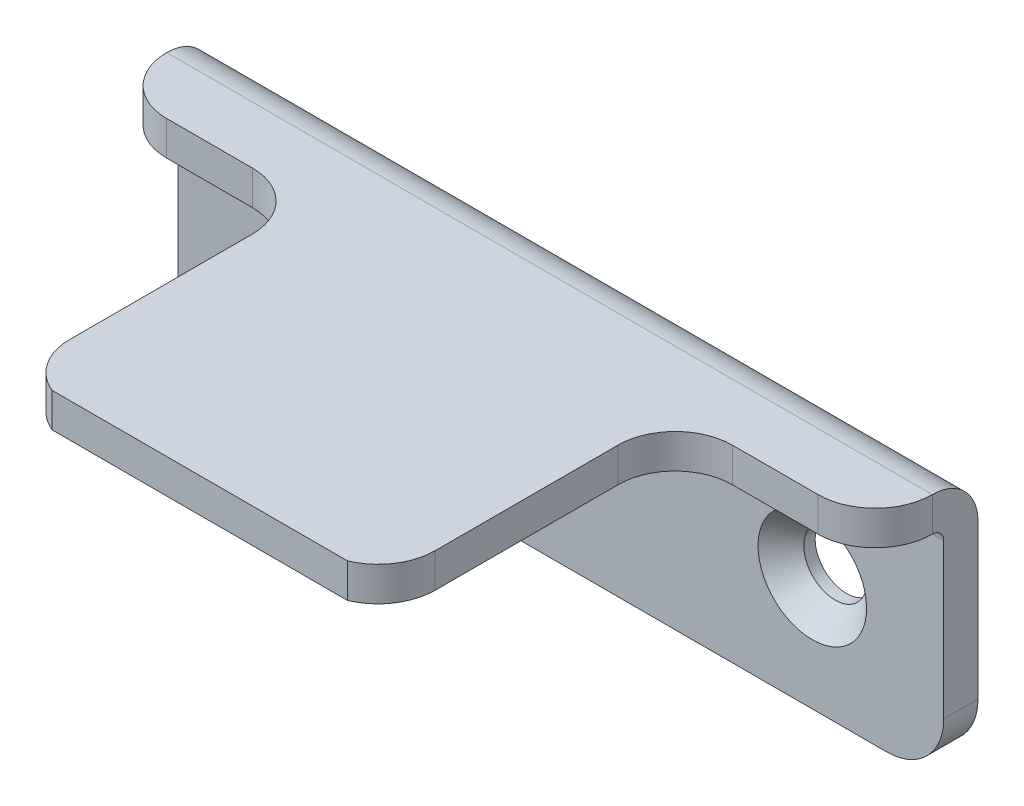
ISO-10303-21;
HEADER;
FILE_DESCRIPTION(('STEP AP214'),'2;1');
FILE_NAME('part.step','',(''),(''),'','','');
FILE_SCHEMA(('AUTOMOTIVE_DESIGN { 1 0 10303 214 1 1 1 1 }'));
ENDSEC;
DATA;
#1=APPLICATION_CONTEXT('core data for automotive mechanical design processes');
#2=APPLICATION_PROTOCOL_DEFINITION('international standard','automotive_design',2000,#1);
#3=PRODUCT_CONTEXT('',#1,'mechanical');
#4=PRODUCT('Part','Part','',(#3));
#5=PRODUCT_RELATED_PRODUCT_CATEGORY('part','',(#4));
#6=PRODUCT_DEFINITION_FORMATION('','',#4);
#7=PRODUCT_DEFINITION_CONTEXT('part definition',#1,'design');
#8=PRODUCT_DEFINITION('design','',#6,#7);
#9=PRODUCT_DEFINITION_SHAPE('','',#8);
#10=(LENGTH_UNIT() NAMED_UNIT(*) SI_UNIT(.MILLI.,.METRE.));
#11=(NAMED_UNIT(*) PLANE_ANGLE_UNIT() SI_UNIT($,.RADIAN.));
#12=(NAMED_UNIT(*) SI_UNIT($,.STERADIAN.) SOLID_ANGLE_UNIT());
#13=UNCERTAINTY_MEASURE_WITH_UNIT(LENGTH_MEASURE(1.E-05),#10,'distance_accuracy_value','');
#14=(GEOMETRIC_REPRESENTATION_CONTEXT(3) GLOBAL_UNCERTAINTY_ASSIGNED_CONTEXT((#13)) GLOBAL_UNIT_ASSIGNED_CONTEXT((#10,
#11,#12)) REPRESENTATION_CONTEXT('',''));
#15=CARTESIAN_POINT('',(0.,0.,0.));
#16=DIRECTION('',(0.,0.,1.));
#17=DIRECTION('',(1.,0.,0.));
#18=AXIS2_PLACEMENT_3D('',#15,#16,#17);
#19=CARTESIAN_POINT('',(-22.,10.5,27.));
#20=DIRECTION('',(0.,1.,0.));
#21=DIRECTION('',(0.,0.,1.));
#22=AXIS2_PLACEMENT_3D('',#19,#20,#21);
#23=PLANE('',#22);
#24=CARTESIAN_POINT('',(-22.,10.5,27.));
#25=DIRECTION('',(0.,1.,0.));
#26=DIRECTION('',(0.,0.,1.));
#27=AXIS2_PLACEMENT_3D('',#24,#25,#26);
#28=CIRCLE('',#27,1.5);
#29=CARTESIAN_POINT('',(-22.,10.5,28.5));
#30=VERTEX_POINT('',#29);
#31=EDGE_CURVE('E18',#30,#30,#28,.F.);
#32=ORIENTED_EDGE('',*,*,#31,.T.);
#33=EDGE_LOOP('',(#32));
#34=FACE_BOUND('',#33,.T.);
#35=ADVANCED_FACE('F15',(#34),#23,.F.);
#36=CARTESIAN_POINT('',(-22.,9.49999999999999,27.));
#37=DIRECTION('',(0.,1.,0.));
#38=DIRECTION('',(0.,0.,1.));
#39=AXIS2_PLACEMENT_3D('',#36,#37,#38);
#40=CYLINDRICAL_SURFACE('',#39,1.5);
#41=CARTESIAN_POINT('',(-22.,9.49999999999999,27.));
#42=DIRECTION('',(0.,1.,0.));
#43=DIRECTION('',(0.,0.,1.));
#44=AXIS2_PLACEMENT_3D('',#41,#42,#43);
#45=CIRCLE('',#44,1.5);
#46=CARTESIAN_POINT('',(-22.,9.49999999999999,28.5));
#47=VERTEX_POINT('',#46);
#48=EDGE_CURVE('E177',#47,#47,#45,.T.);
#49=ORIENTED_EDGE('',*,*,#48,.F.);
#50=EDGE_LOOP('',(#49));
#51=FACE_BOUND('',#50,.T.);
#52=ORIENTED_EDGE('',*,*,#31,.F.);
#53=EDGE_LOOP('',(#52));
#54=FACE_BOUND('',#53,.T.);
#55=ADVANCED_FACE('F422',(#51,#54),#40,.F.);
#56=CARTESIAN_POINT('',(-43.0000000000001,23.5,9.00000000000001));
#57=DIRECTION('',(0.,0.,-1.));
#58=DIRECTION('',(-1.,0.,0.));
#59=AXIS2_PLACEMENT_3D('',#56,#57,#58);
#60=PLANE('',#59);
#61=DIRECTION('',(0.,-1.,0.));
#62=VECTOR('',#61,1.);
#63=CARTESIAN_POINT('',(-50.5000000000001,23.5,9.00000000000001));
#64=LINE('',#63,#62);
#65=CARTESIAN_POINT('',(-50.5000000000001,9.49999999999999,9.00000000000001));
#66=VERTEX_POINT('',#65);
#67=CARTESIAN_POINT('',(-50.5000000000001,12.5,9.00000000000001));
#68=VERTEX_POINT('',#67);
#69=EDGE_CURVE('E188',#66,#68,#64,.F.);
#70=ORIENTED_EDGE('',*,*,#69,.F.);
#71=DIRECTION('',(1.,0.,0.));
#72=VECTOR('',#71,1.);
#73=CARTESIAN_POINT('',(11.5,9.49999999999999,9.00000000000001));
#74=LINE('',#73,#72);
#75=CARTESIAN_POINT('',(-43.0000000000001,9.49999999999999,9.00000000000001));
#76=VERTEX_POINT('',#75);
#77=EDGE_CURVE('E176',#76,#66,#74,.F.);
#78=ORIENTED_EDGE('',*,*,#77,.F.);
#79=DIRECTION('',(0.,-1.,0.));
#80=VECTOR('',#79,1.);
#81=CARTESIAN_POINT('',(-43.0000000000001,23.5,9.00000000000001));
#82=LINE('',#81,#80);
#83=CARTESIAN_POINT('',(-43.0000000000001,12.5,9.00000000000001));
#84=VERTEX_POINT('',#83);
#85=EDGE_CURVE('E251',#76,#84,#82,.F.);
#86=ORIENTED_EDGE('',*,*,#85,.T.);
#87=DIRECTION('',(1.,0.,0.));
#88=VECTOR('',#87,1.);
#89=CARTESIAN_POINT('',(11.5,12.5,9.00000000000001));
#90=LINE('',#89,#88);
#91=EDGE_CURVE('E192',#68,#84,#90,.T.);
#92=ORIENTED_EDGE('',*,*,#91,.F.);
#93=EDGE_LOOP('',(#70,#78,#86,#92));
#94=FACE_BOUND('',#93,.T.);
#95=ADVANCED_FACE('F420',(#94),#60,.F.);
#96=CARTESIAN_POINT('',(-43.0000000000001,23.5,14.));
#97=DIRECTION('',(0.,-1.,0.));
#98=DIRECTION('',(0.,0.,-1.));
#99=AXIS2_PLACEMENT_3D('',#96,#97,#98);
#100=CYLINDRICAL_SURFACE('',#99,5.);
#101=ORIENTED_EDGE('',*,*,#85,.F.);
#102=CARTESIAN_POINT('',(-43.0000000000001,9.49999999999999,14.));
#103=DIRECTION('',(0.,-1.,0.));
#104=DIRECTION('',(0.,0.,-1.));
#105=AXIS2_PLACEMENT_3D('',#102,#103,#104);
#106=CIRCLE('',#105,5.);
#107=CARTESIAN_POINT('',(-38.0000000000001,9.49999999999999,14.));
#108=VERTEX_POINT('',#107);
#109=EDGE_CURVE('E174',#108,#76,#106,.F.);
#110=ORIENTED_EDGE('',*,*,#109,.F.);
#111=DIRECTION('',(0.,1.,0.));
#112=VECTOR('',#111,1.);
#113=CARTESIAN_POINT('',(-38.0000000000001,23.5,14.));
#114=LINE('',#113,#112);
#115=CARTESIAN_POINT('',(-38.0000000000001,12.5,14.));
#116=VERTEX_POINT('',#115);
#117=EDGE_CURVE('E253',#108,#116,#114,.T.);
#118=ORIENTED_EDGE('',*,*,#117,.T.);
#119=CARTESIAN_POINT('',(-43.0000000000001,12.5,14.));
#120=DIRECTION('',(0.,-1.,0.));
#121=DIRECTION('',(0.,0.,-1.));
#122=AXIS2_PLACEMENT_3D('',#119,#120,#121);
#123=CIRCLE('',#122,5.);
#124=EDGE_CURVE('E193',#84,#116,#123,.T.);
#125=ORIENTED_EDGE('',*,*,#124,.F.);
#126=EDGE_LOOP('',(#101,#110,#118,#125));
#127=FACE_BOUND('',#126,.T.);
#128=ADVANCED_FACE('F416',(#127),#100,.F.);
#129=CARTESIAN_POINT('',(-38.0000000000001,23.5,30.));
#130=DIRECTION('',(1.,0.,0.));
#131=DIRECTION('',(0.,0.,-1.));
#132=AXIS2_PLACEMENT_3D('',#129,#130,#131);
#133=PLANE('',#132);
#134=ORIENTED_EDGE('',*,*,#117,.F.);
#135=DIRECTION('',(0.,0.,-1.));
#136=VECTOR('',#135,1.);
#137=CARTESIAN_POINT('',(-38.0000000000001,9.49999999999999,8.99999999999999));
#138=LINE('',#137,#136);
#139=CARTESIAN_POINT('',(-38.0000000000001,9.49999999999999,30.));
#140=VERTEX_POINT('',#139);
#141=EDGE_CURVE('E173',#140,#108,#138,.T.);
#142=ORIENTED_EDGE('',*,*,#141,.F.);
#143=DIRECTION('',(0.,-1.,0.));
#144=VECTOR('',#143,1.);
#145=CARTESIAN_POINT('',(-38.0000000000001,23.5,30.));
#146=LINE('',#145,#144);
#147=CARTESIAN_POINT('',(-38.0000000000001,12.5,30.));
#148=VERTEX_POINT('',#147);
#149=EDGE_CURVE('E255',#148,#140,#146,.T.);
#150=ORIENTED_EDGE('',*,*,#149,.F.);
#151=DIRECTION('',(0.,0.,1.));
#152=VECTOR('',#151,1.);
#153=CARTESIAN_POINT('',(-38.0000000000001,12.5,30.));
#154=LINE('',#153,#152);
#155=EDGE_CURVE('E196',#116,#148,#154,.T.);
#156=ORIENTED_EDGE('',*,*,#155,.F.);
#157=EDGE_LOOP('',(#134,#142,#150,#156));
#158=FACE_BOUND('',#157,.T.);
#159=ADVANCED_FACE('F413',(#158),#133,.F.);
#160=CARTESIAN_POINT('',(-33.0000000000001,23.5,30.));
#161=DIRECTION('',(0.,-1.,0.));
#162=DIRECTION('',(0.,0.,-1.));
#163=AXIS2_PLACEMENT_3D('',#160,#161,#162);
#164=CYLINDRICAL_SURFACE('',#163,5.);
#165=CARTESIAN_POINT('',(-33.0000000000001,9.49999999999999,30.));
#166=DIRECTION('',(0.,-1.,0.));
#167=DIRECTION('',(0.,0.,-1.));
#168=AXIS2_PLACEMENT_3D('',#165,#166,#167);
#169=CIRCLE('',#168,5.);
#170=CARTESIAN_POINT('',(-34.923076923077,9.49999999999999,34.6153846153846));
#171=VERTEX_POINT('',#170);
#172=EDGE_CURVE('E170',#171,#140,#169,.T.);
#173=ORIENTED_EDGE('',*,*,#172,.F.);
#174=DIRECTION('',(0.,1.,0.));
#175=VECTOR('',#174,1.);
#176=CARTESIAN_POINT('',(-34.923076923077,23.5,34.6153846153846));
#177=LINE('',#176,#175);
#178=CARTESIAN_POINT('',(-34.923076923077,12.5,34.6153846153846));
#179=VERTEX_POINT('',#178);
#180=EDGE_CURVE('E257',#171,#179,#177,.T.);
#181=ORIENTED_EDGE('',*,*,#180,.T.);
#182=CARTESIAN_POINT('',(-33.0000000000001,12.5,30.));
#183=DIRECTION('',(0.,-1.,0.));
#184=DIRECTION('',(0.,0.,-1.));
#185=AXIS2_PLACEMENT_3D('',#182,#183,#184);
#186=CIRCLE('',#185,5.);
#187=EDGE_CURVE('E197',#148,#179,#186,.F.);
#188=ORIENTED_EDGE('',*,*,#187,.F.);
#189=ORIENTED_EDGE('',*,*,#149,.T.);
#190=EDGE_LOOP('',(#173,#181,#188,#189));
#191=FACE_BOUND('',#190,.T.);
#192=ADVANCED_FACE('F409',(#191),#164,.T.);
#193=CARTESIAN_POINT('',(-9.07692307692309,23.5,34.6153846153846));
#194=DIRECTION('',(0.,0.,-1.));
#195=DIRECTION('',(-1.,0.,0.));
#196=AXIS2_PLACEMENT_3D('',#193,#194,#195);
#197=PLANE('',#196);
#198=ORIENTED_EDGE('',*,*,#180,.F.);
#199=DIRECTION('',(1.,0.,0.));
#200=VECTOR('',#199,1.);
#201=CARTESIAN_POINT('',(11.5,9.49999999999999,34.6153846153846));
#202=LINE('',#201,#200);
#203=CARTESIAN_POINT('',(-9.07692307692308,9.49999999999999,34.6153846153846));
#204=VERTEX_POINT('',#203);
#205=EDGE_CURVE('E169',#204,#171,#202,.F.);
#206=ORIENTED_EDGE('',*,*,#205,.F.);
#207=DIRECTION('',(0.,-1.,0.));
#208=VECTOR('',#207,1.);
#209=CARTESIAN_POINT('',(-9.07692307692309,23.5,34.6153846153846));
#210=LINE('',#209,#208);
#211=CARTESIAN_POINT('',(-9.07692307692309,12.5,34.6153846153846));
#212=VERTEX_POINT('',#211);
#213=EDGE_CURVE('E259',#212,#204,#210,.T.);
#214=ORIENTED_EDGE('',*,*,#213,.F.);
#215=DIRECTION('',(1.,0.,0.));
#216=VECTOR('',#215,1.);
#217=CARTESIAN_POINT('',(11.5,12.5,34.6153846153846));
#218=LINE('',#217,#216);
#219=EDGE_CURVE('E200',#179,#212,#218,.T.);
#220=ORIENTED_EDGE('',*,*,#219,.F.);
#221=EDGE_LOOP('',(#198,#206,#214,#220));
#222=FACE_BOUND('',#221,.T.);
#223=ADVANCED_FACE('F406',(#222),#197,.F.);
#224=CARTESIAN_POINT('',(-11.,23.5,30.));
#225=DIRECTION('',(0.,-1.,0.));
#226=DIRECTION('',(0.,0.,-1.));
#227=AXIS2_PLACEMENT_3D('',#224,#225,#226);
#228=CYLINDRICAL_SURFACE('',#227,5.);
#229=CARTESIAN_POINT('',(-11.,9.49999999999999,30.));
#230=DIRECTION('',(0.,-1.,0.));
#231=DIRECTION('',(0.,0.,-1.));
#232=AXIS2_PLACEMENT_3D('',#229,#230,#231);
#233=CIRCLE('',#232,5.);
#234=CARTESIAN_POINT('',(-6.00000000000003,9.49999999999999,30.));
#235=VERTEX_POINT('',#234);
#236=EDGE_CURVE('E160',#235,#204,#233,.T.);
#237=ORIENTED_EDGE('',*,*,#236,.F.);
#238=DIRECTION('',(0.,1.,0.));
#239=VECTOR('',#238,1.);
#240=CARTESIAN_POINT('',(-6.00000000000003,23.5,30.));
#241=LINE('',#240,#239);
#242=CARTESIAN_POINT('',(-6.00000000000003,12.5,30.));
#243=VERTEX_POINT('',#242);
#244=EDGE_CURVE('E152',#235,#243,#241,.T.);
#245=ORIENTED_EDGE('',*,*,#244,.T.);
#246=CARTESIAN_POINT('',(-11.,12.5,30.));
#247=DIRECTION('',(0.,-1.,0.));
#248=DIRECTION('',(0.,0.,-1.));
#249=AXIS2_PLACEMENT_3D('',#246,#247,#248);
#250=CIRCLE('',#249,5.);
#251=EDGE_CURVE('E201',#212,#243,#250,.F.);
#252=ORIENTED_EDGE('',*,*,#251,.F.);
#253=ORIENTED_EDGE('',*,*,#213,.T.);
#254=EDGE_LOOP('',(#237,#245,#252,#253));
#255=FACE_BOUND('',#254,.T.);
#256=ADVANCED_FACE('F402',(#255),#228,.T.);
#257=CARTESIAN_POINT('',(-6.00000000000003,23.5,14.));
#258=DIRECTION('',(-1.,0.,0.));
#259=DIRECTION('',(0.,0.,1.));
#260=AXIS2_PLACEMENT_3D('',#257,#258,#259);
#261=PLANE('',#260);
#262=ORIENTED_EDGE('',*,*,#244,.F.);
#263=DIRECTION('',(0.,0.,-1.));
#264=VECTOR('',#263,1.);
#265=CARTESIAN_POINT('',(-6.00000000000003,9.49999999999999,8.99999999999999));
#266=LINE('',#265,#264);
#267=CARTESIAN_POINT('',(-6.00000000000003,9.49999999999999,14.));
#268=VERTEX_POINT('',#267);
#269=EDGE_CURVE('E155',#268,#235,#266,.F.);
#270=ORIENTED_EDGE('',*,*,#269,.F.);
#271=DIRECTION('',(0.,-1.,0.));
#272=VECTOR('',#271,1.);
#273=CARTESIAN_POINT('',(-6.00000000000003,23.5,14.));
#274=LINE('',#273,#272);
#275=CARTESIAN_POINT('',(-6.00000000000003,12.5,14.));
#276=VERTEX_POINT('',#275);
#277=EDGE_CURVE('E141',#268,#276,#274,.F.);
#278=ORIENTED_EDGE('',*,*,#277,.T.);
#279=DIRECTION('',(0.,0.,1.));
#280=VECTOR('',#279,1.);
#281=CARTESIAN_POINT('',(-6.00000000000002,12.5,30.));
#282=LINE('',#281,#280);
#283=EDGE_CURVE('E204',#243,#276,#282,.F.);
#284=ORIENTED_EDGE('',*,*,#283,.F.);
#285=EDGE_LOOP('',(#262,#270,#278,#284));
#286=FACE_BOUND('',#285,.T.);
#287=ADVANCED_FACE('F156',(#286),#261,.F.);
#288=CARTESIAN_POINT('',(-1.00000000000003,23.5,14.));
#289=DIRECTION('',(0.,-1.,0.));
#290=DIRECTION('',(0.,0.,-1.));
#291=AXIS2_PLACEMENT_3D('',#288,#289,#290);
#292=CYLINDRICAL_SURFACE('',#291,5.);
#293=ORIENTED_EDGE('',*,*,#277,.F.);
#294=CARTESIAN_POINT('',(-1.00000000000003,9.49999999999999,14.));
#295=DIRECTION('',(0.,-1.,0.));
#296=DIRECTION('',(0.,0.,-1.));
#297=AXIS2_PLACEMENT_3D('',#294,#295,#296);
#298=CIRCLE('',#297,5.);
#299=CARTESIAN_POINT('',(-1.00000000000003,9.49999999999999,8.99999999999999));
#300=VERTEX_POINT('',#299);
#301=EDGE_CURVE('E145',#300,#268,#298,.F.);
#302=ORIENTED_EDGE('',*,*,#301,.F.);
#303=DIRECTION('',(0.,1.,0.));
#304=VECTOR('',#303,1.);
#305=CARTESIAN_POINT('',(-1.00000000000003,23.5,8.99999999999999));
#306=LINE('',#305,#304);
#307=CARTESIAN_POINT('',(-1.00000000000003,12.5,8.99999999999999));
#308=VERTEX_POINT('',#307);
#309=EDGE_CURVE('E136',#300,#308,#306,.T.);
#310=ORIENTED_EDGE('',*,*,#309,.T.);
#311=CARTESIAN_POINT('',(-1.00000000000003,12.5,14.));
#312=DIRECTION('',(0.,-1.,0.));
#313=DIRECTION('',(0.,0.,-1.));
#314=AXIS2_PLACEMENT_3D('',#311,#312,#313);
#315=CIRCLE('',#314,5.);
#316=EDGE_CURVE('E148',#276,#308,#315,.T.);
#317=ORIENTED_EDGE('',*,*,#316,.F.);
#318=EDGE_LOOP('',(#293,#302,#310,#317));
#319=FACE_BOUND('',#318,.T.);
#320=ADVANCED_FACE('F143',(#319),#292,.F.);
#321=CARTESIAN_POINT('',(6.5,23.5,8.99999999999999));
#322=DIRECTION('',(0.,0.,-1.));
#323=DIRECTION('',(-1.,0.,0.));
#324=AXIS2_PLACEMENT_3D('',#321,#322,#323);
#325=PLANE('',#324);
#326=ORIENTED_EDGE('',*,*,#309,.F.);
#327=DIRECTION('',(1.,0.,0.));
#328=VECTOR('',#327,1.);
#329=CARTESIAN_POINT('',(11.5,9.49999999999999,8.99999999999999));
#330=LINE('',#329,#328);
#331=CARTESIAN_POINT('',(6.5,9.49999999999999,8.99999999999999));
#332=VERTEX_POINT('',#331);
#333=EDGE_CURVE('E165',#332,#300,#330,.F.);
#334=ORIENTED_EDGE('',*,*,#333,.F.);
#335=DIRECTION('',(0.,-1.,0.));
#336=VECTOR('',#335,1.);
#337=CARTESIAN_POINT('',(6.5,23.5,8.99999999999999));
#338=LINE('',#337,#336);
#339=CARTESIAN_POINT('',(6.5,12.5,8.99999999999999));
#340=VERTEX_POINT('',#339);
#341=EDGE_CURVE('E210',#340,#332,#338,.T.);
#342=ORIENTED_EDGE('',*,*,#341,.F.);
#343=DIRECTION('',(1.,0.,0.));
#344=VECTOR('',#343,1.);
#345=CARTESIAN_POINT('',(11.5,12.5,8.99999999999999));
#346=LINE('',#345,#344);
#347=EDGE_CURVE('E206',#308,#340,#346,.T.);
#348=ORIENTED_EDGE('',*,*,#347,.F.);
#349=EDGE_LOOP('',(#326,#334,#342,#348));
#350=FACE_BOUND('',#349,.T.);
#351=ADVANCED_FACE('F396',(#350),#325,.F.);
#352=CARTESIAN_POINT('',(11.5,9.49999999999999,8.99999999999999));
#353=DIRECTION('',(0.,-1.,0.));
#354=DIRECTION('',(0.,0.,-1.));
#355=AXIS2_PLACEMENT_3D('',#352,#353,#354);
#356=PLANE('',#355);
#357=ORIENTED_EDGE('',*,*,#48,.T.);
#358=EDGE_LOOP('',(#357));
#359=FACE_BOUND('',#358,.T.);
#360=ORIENTED_EDGE('',*,*,#109,.T.);
#361=ORIENTED_EDGE('',*,*,#77,.T.);
#362=CARTESIAN_POINT('',(-50.5000000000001,9.49999999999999,4.00000000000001));
#363=DIRECTION('',(0.,-1.,0.));
#364=DIRECTION('',(0.,0.,-1.));
#365=AXIS2_PLACEMENT_3D('',#362,#363,#364);
#366=CIRCLE('',#365,5.);
#367=CARTESIAN_POINT('',(-55.5,9.49999999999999,4.));
#368=VERTEX_POINT('',#367);
#369=EDGE_CURVE('E185',#368,#66,#366,.F.);
#370=ORIENTED_EDGE('',*,*,#369,.F.);
#371=DIRECTION('',(-1.,0.,0.));
#372=VECTOR('',#371,1.);
#373=CARTESIAN_POINT('',(11.5,9.49999999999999,3.99999999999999));
#374=LINE('',#373,#372);
#375=CARTESIAN_POINT('',(11.5,9.49999999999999,4.));
#376=VERTEX_POINT('',#375);
#377=EDGE_CURVE('E180',#368,#376,#374,.F.);
#378=ORIENTED_EDGE('',*,*,#377,.T.);
#379=CARTESIAN_POINT('',(6.50000000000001,9.49999999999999,3.99999999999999));
#380=DIRECTION('',(0.,-1.,0.));
#381=DIRECTION('',(0.,0.,-1.));
#382=AXIS2_PLACEMENT_3D('',#379,#380,#381);
#383=CIRCLE('',#382,5.);
#384=EDGE_CURVE('E211',#332,#376,#383,.F.);
#385=ORIENTED_EDGE('',*,*,#384,.F.);
#386=ORIENTED_EDGE('',*,*,#333,.T.);
#387=ORIENTED_EDGE('',*,*,#301,.T.);
#388=ORIENTED_EDGE('',*,*,#269,.T.);
#389=ORIENTED_EDGE('',*,*,#236,.T.);
#390=ORIENTED_EDGE('',*,*,#205,.T.);
#391=ORIENTED_EDGE('',*,*,#172,.T.);
#392=ORIENTED_EDGE('',*,*,#141,.T.);
#393=EDGE_LOOP('',(#360,#361,#370,#378,#385,#386,#387,#388,#389,#390,#391,#392));
#394=FACE_BOUND('',#393,.T.);
#395=ADVANCED_FACE('F163',(#359,#394),#356,.T.);
#396=CARTESIAN_POINT('',(11.5,8.49999999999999,3.99999999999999));
#397=DIRECTION('',(-1.,0.,0.));
#398=DIRECTION('',(0.,0.,1.));
#399=AXIS2_PLACEMENT_3D('',#396,#397,#398);
#400=CYLINDRICAL_SURFACE('',#399,1.);
#401=DIRECTION('',(1.,0.,0.));
#402=VECTOR('',#401,1.);
#403=CARTESIAN_POINT('',(11.5,8.49999999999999,2.99999999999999));
#404=LINE('',#403,#402);
#405=CARTESIAN_POINT('',(11.5,8.49999999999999,2.99999999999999));
#406=VERTEX_POINT('',#405);
#407=CARTESIAN_POINT('',(-55.5,8.49999999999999,2.99999999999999));
#408=VERTEX_POINT('',#407);
#409=EDGE_CURVE('E214',#406,#408,#404,.F.);
#410=ORIENTED_EDGE('',*,*,#409,.F.);
#411=CARTESIAN_POINT('',(11.5,8.49999999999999,3.99999999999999));
#412=DIRECTION('',(-1.,0.,0.));
#413=DIRECTION('',(0.,0.,1.));
#414=AXIS2_PLACEMENT_3D('',#411,#412,#413);
#415=CIRCLE('',#414,1.);
#416=EDGE_CURVE('E181',#376,#406,#415,.T.);
#417=ORIENTED_EDGE('',*,*,#416,.F.);
#418=ORIENTED_EDGE('',*,*,#377,.F.);
#419=CARTESIAN_POINT('',(-55.5,8.49999999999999,3.99999999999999));
#420=DIRECTION('',(-1.,0.,0.));
#421=DIRECTION('',(0.,0.,1.));
#422=AXIS2_PLACEMENT_3D('',#419,#420,#421);
#423=CIRCLE('',#422,1.);
#424=EDGE_CURVE('E183',#408,#368,#423,.F.);
#425=ORIENTED_EDGE('',*,*,#424,.F.);
#426=EDGE_LOOP('',(#410,#417,#418,#425));
#427=FACE_BOUND('',#426,.T.);
#428=ADVANCED_FACE('F393',(#427),#400,.F.);
#429=CARTESIAN_POINT('',(-50.5000000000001,23.5,4.00000000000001));
#430=DIRECTION('',(0.,-1.,0.));
#431=DIRECTION('',(0.,0.,-1.));
#432=AXIS2_PLACEMENT_3D('',#429,#430,#431);
#433=CYLINDRICAL_SURFACE('',#432,5.);
#434=ORIENTED_EDGE('',*,*,#369,.T.);
#435=ORIENTED_EDGE('',*,*,#69,.T.);
#436=CARTESIAN_POINT('',(-50.5000000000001,12.5,4.00000000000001));
#437=DIRECTION('',(0.,-1.,0.));
#438=DIRECTION('',(0.,0.,-1.));
#439=AXIS2_PLACEMENT_3D('',#436,#437,#438);
#440=CIRCLE('',#439,5.);
#441=CARTESIAN_POINT('',(-55.5,12.5,4.));
#442=VERTEX_POINT('',#441);
#443=EDGE_CURVE('E189',#442,#68,#440,.F.);
#444=ORIENTED_EDGE('',*,*,#443,.F.);
#445=DIRECTION('',(0.,1.,0.));
#446=VECTOR('',#445,1.);
#447=CARTESIAN_POINT('',(-55.5,6.56286455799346,4.));
#448=LINE('',#447,#446);
#449=EDGE_CURVE('E287',#442,#368,#448,.F.);
#450=ORIENTED_EDGE('',*,*,#449,.T.);
#451=EDGE_LOOP('',(#434,#435,#444,#450));
#452=FACE_BOUND('',#451,.T.);
#453=ADVANCED_FACE('F390',(#452),#433,.T.);
#454=CARTESIAN_POINT('',(11.5,12.5,30.));
#455=DIRECTION('',(0.,1.,0.));
#456=DIRECTION('',(0.,0.,1.));
#457=AXIS2_PLACEMENT_3D('',#454,#455,#456);
#458=PLANE('',#457);
#459=CARTESIAN_POINT('',(6.50000000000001,12.5,3.99999999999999));
#460=DIRECTION('',(0.,-1.,0.));
#461=DIRECTION('',(0.,0.,-1.));
#462=AXIS2_PLACEMENT_3D('',#459,#460,#461);
#463=CIRCLE('',#462,5.);
#464=CARTESIAN_POINT('',(11.5,12.5,4.));
#465=VERTEX_POINT('',#464);
#466=EDGE_CURVE('E207',#465,#340,#463,.T.);
#467=ORIENTED_EDGE('',*,*,#466,.F.);
#468=DIRECTION('',(-1.,0.,0.));
#469=VECTOR('',#468,1.);
#470=CARTESIAN_POINT('',(11.5,12.5,4.));
#471=LINE('',#470,#469);
#472=EDGE_CURVE('E227',#442,#465,#471,.F.);
#473=ORIENTED_EDGE('',*,*,#472,.F.);
#474=ORIENTED_EDGE('',*,*,#443,.T.);
#475=ORIENTED_EDGE('',*,*,#91,.T.);
#476=ORIENTED_EDGE('',*,*,#124,.T.);
#477=ORIENTED_EDGE('',*,*,#155,.T.);
#478=ORIENTED_EDGE('',*,*,#187,.T.);
#479=ORIENTED_EDGE('',*,*,#219,.T.);
#480=ORIENTED_EDGE('',*,*,#251,.T.);
#481=ORIENTED_EDGE('',*,*,#283,.T.);
#482=ORIENTED_EDGE('',*,*,#316,.T.);
#483=ORIENTED_EDGE('',*,*,#347,.T.);
#484=EDGE_LOOP('',(#467,#473,#474,#475,#476,#477,#478,#479,#480,#481,#482,#483));
#485=FACE_BOUND('',#484,.T.);
#486=ADVANCED_FACE('F398',(#485),#458,.T.);
#487=CARTESIAN_POINT('',(6.50000000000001,23.5,3.99999999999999));
#488=DIRECTION('',(0.,-1.,0.));
#489=DIRECTION('',(0.,0.,-1.));
#490=AXIS2_PLACEMENT_3D('',#487,#488,#489);
#491=CYLINDRICAL_SURFACE('',#490,5.);
#492=ORIENTED_EDGE('',*,*,#384,.T.);
#493=DIRECTION('',(0.,1.,0.));
#494=VECTOR('',#493,1.);
#495=CARTESIAN_POINT('',(11.5,6.56286455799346,4.));
#496=LINE('',#495,#494);
#497=EDGE_CURVE('E232',#465,#376,#496,.F.);
#498=ORIENTED_EDGE('',*,*,#497,.F.);
#499=ORIENTED_EDGE('',*,*,#466,.T.);
#500=ORIENTED_EDGE('',*,*,#341,.T.);
#501=EDGE_LOOP('',(#492,#498,#499,#500));
#502=FACE_BOUND('',#501,.T.);
#503=ADVANCED_FACE('F381',(#502),#491,.T.);
#504=CARTESIAN_POINT('',(11.5,-5.00000000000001,2.99999999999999));
#505=DIRECTION('',(0.,0.,1.));
#506=DIRECTION('',(1.,0.,0.));
#507=AXIS2_PLACEMENT_3D('',#504,#505,#506);
#508=PLANE('',#507);
#509=CARTESIAN_POINT('',(-44.,0.,3.00000000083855));
#510=DIRECTION('',(0.,0.,1.));
#511=DIRECTION('',(1.,0.,0.));
#512=AXIS2_PLACEMENT_3D('',#509,#510,#511);
#513=CIRCLE('',#512,4.7499999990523);
#514=CARTESIAN_POINT('',(-39.2500000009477,0.,3.00000000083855));
#515=VERTEX_POINT('',#514);
#516=EDGE_CURVE('E218',#515,#515,#513,.F.);
#517=ORIENTED_EDGE('',*,*,#516,.T.);
#518=EDGE_LOOP('',(#517));
#519=FACE_BOUND('',#518,.T.);
#520=CARTESIAN_POINT('',(0.,0.,3.0000000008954));
#521=DIRECTION('',(0.,0.,1.));
#522=DIRECTION('',(0.,-1.,0.));
#523=AXIS2_PLACEMENT_3D('',#520,#521,#522);
#524=CIRCLE('',#523,4.74999999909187);
#525=CARTESIAN_POINT('',(0.,-4.74999999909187,3.0000000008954));
#526=VERTEX_POINT('',#525);
#527=EDGE_CURVE('E215',#526,#526,#524,.F.);
#528=ORIENTED_EDGE('',*,*,#527,.T.);
#529=EDGE_LOOP('',(#528));
#530=FACE_BOUND('',#529,.T.);
#531=ORIENTED_EDGE('',*,*,#409,.T.);
#532=DIRECTION('',(0.,1.,0.));
#533=VECTOR('',#532,1.);
#534=CARTESIAN_POINT('',(-55.5,6.56286455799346,2.99999999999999));
#535=LINE('',#534,#533);
#536=CARTESIAN_POINT('',(-55.5,-5.,2.99999999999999));
#537=VERTEX_POINT('',#536);
#538=EDGE_CURVE('E228',#408,#537,#535,.F.);
#539=ORIENTED_EDGE('',*,*,#538,.T.);
#540=CARTESIAN_POINT('',(-50.5,-5.,2.99999999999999));
#541=DIRECTION('',(0.,0.,-1.));
#542=DIRECTION('',(-1.,0.,0.));
#543=AXIS2_PLACEMENT_3D('',#540,#541,#542);
#544=CIRCLE('',#543,5.);
#545=CARTESIAN_POINT('',(-50.5,-10.,2.99999999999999));
#546=VERTEX_POINT('',#545);
#547=EDGE_CURVE('E221',#546,#537,#544,.T.);
#548=ORIENTED_EDGE('',*,*,#547,.F.);
#549=DIRECTION('',(1.,0.,0.));
#550=VECTOR('',#549,1.);
#551=CARTESIAN_POINT('',(11.5,-10.,2.99999999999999));
#552=LINE('',#551,#550);
#553=CARTESIAN_POINT('',(6.49999999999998,-10.,2.99999999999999));
#554=VERTEX_POINT('',#553);
#555=EDGE_CURVE('E282',#554,#546,#552,.F.);
#556=ORIENTED_EDGE('',*,*,#555,.F.);
#557=CARTESIAN_POINT('',(6.49999999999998,-5.,2.99999999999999));
#558=DIRECTION('',(0.,0.,-1.));
#559=DIRECTION('',(-1.,0.,0.));
#560=AXIS2_PLACEMENT_3D('',#557,#558,#559);
#561=CIRCLE('',#560,5.);
#562=CARTESIAN_POINT('',(11.5,-5.,2.99999999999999));
#563=VERTEX_POINT('',#562);
#564=EDGE_CURVE('E233',#563,#554,#561,.T.);
#565=ORIENTED_EDGE('',*,*,#564,.F.);
#566=DIRECTION('',(0.,1.,0.));
#567=VECTOR('',#566,1.);
#568=CARTESIAN_POINT('',(11.5,6.56286455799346,2.99999999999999));
#569=LINE('',#568,#567);
#570=EDGE_CURVE('E297',#406,#563,#569,.F.);
#571=ORIENTED_EDGE('',*,*,#570,.F.);
#572=EDGE_LOOP('',(#531,#539,#548,#556,#565,#571));
#573=FACE_BOUND('',#572,.T.);
#574=ADVANCED_FACE('F375',(#519,#530,#573),#508,.T.);
#575=CARTESIAN_POINT('',(0.,0.,3.0000000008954));
#576=DIRECTION('',(0.,0.,1.));
#577=DIRECTION('',(0.,-1.,0.));
#578=AXIS2_PLACEMENT_3D('',#575,#576,#577);
#579=CONICAL_SURFACE('',#578,4.74999999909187,0.785398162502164);
#580=CARTESIAN_POINT('',(0.,0.,0.999999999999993));
#581=DIRECTION('',(0.,0.,1.));
#582=DIRECTION('',(1.,0.,0.));
#583=AXIS2_PLACEMENT_3D('',#580,#581,#582);
#584=CIRCLE('',#583,2.75);
#585=CARTESIAN_POINT('',(2.75,0.,0.999999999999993));
#586=VERTEX_POINT('',#585);
#587=EDGE_CURVE('E285',#586,#586,#584,.F.);
#588=ORIENTED_EDGE('',*,*,#587,.T.);
#589=EDGE_LOOP('',(#588));
#590=FACE_BOUND('',#589,.T.);
#591=ORIENTED_EDGE('',*,*,#527,.F.);
#592=EDGE_LOOP('',(#591));
#593=FACE_BOUND('',#592,.T.);
#594=ADVANCED_FACE('F371',(#590,#593),#579,.F.);
#595=CARTESIAN_POINT('',(-44.,0.,3.00000000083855));
#596=DIRECTION('',(0.,0.,1.));
#597=DIRECTION('',(1.,0.,0.));
#598=AXIS2_PLACEMENT_3D('',#595,#596,#597);
#599=CONICAL_SURFACE('',#598,4.7499999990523,0.785398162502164);
#600=CARTESIAN_POINT('',(-44.,0.,0.999999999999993));
#601=DIRECTION('',(0.,0.,1.));
#602=DIRECTION('',(1.,0.,0.));
#603=AXIS2_PLACEMENT_3D('',#600,#601,#602);
#604=CIRCLE('',#603,2.75);
#605=CARTESIAN_POINT('',(-41.25,0.,0.999999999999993));
#606=VERTEX_POINT('',#605);
#607=EDGE_CURVE('E241',#606,#606,#604,.F.);
#608=ORIENTED_EDGE('',*,*,#607,.T.);
#609=EDGE_LOOP('',(#608));
#610=FACE_BOUND('',#609,.T.);
#611=ORIENTED_EDGE('',*,*,#516,.F.);
#612=EDGE_LOOP('',(#611));
#613=FACE_BOUND('',#612,.T.);
#614=ADVANCED_FACE('F374',(#610,#613),#599,.F.);
#615=CARTESIAN_POINT('',(-50.5,-5.,11.));
#616=DIRECTION('',(0.,0.,-1.));
#617=DIRECTION('',(-1.,0.,0.));
#618=AXIS2_PLACEMENT_3D('',#615,#616,#617);
#619=CYLINDRICAL_SURFACE('',#618,5.);
#620=ORIENTED_EDGE('',*,*,#547,.T.);
#621=DIRECTION('',(0.,0.,-1.));
#622=VECTOR('',#621,1.);
#623=CARTESIAN_POINT('',(-55.5,-5.,12.3059847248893));
#624=LINE('',#623,#622);
#625=CARTESIAN_POINT('',(-55.5,-5.,0.));
#626=VERTEX_POINT('',#625);
#627=EDGE_CURVE('E223',#537,#626,#624,.T.);
#628=ORIENTED_EDGE('',*,*,#627,.T.);
#629=CARTESIAN_POINT('',(-50.5,-5.,0.));
#630=DIRECTION('',(0.,0.,-1.));
#631=DIRECTION('',(-1.,0.,0.));
#632=AXIS2_PLACEMENT_3D('',#629,#630,#631);
#633=CIRCLE('',#632,5.);
#634=CARTESIAN_POINT('',(-50.5,-10.,0.));
#635=VERTEX_POINT('',#634);
#636=EDGE_CURVE('E237',#635,#626,#633,.T.);
#637=ORIENTED_EDGE('',*,*,#636,.F.);
#638=DIRECTION('',(0.,0.,-1.));
#639=VECTOR('',#638,1.);
#640=CARTESIAN_POINT('',(-50.5,-10.,2.99999999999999));
#641=LINE('',#640,#639);
#642=EDGE_CURVE('E235',#546,#635,#641,.T.);
#643=ORIENTED_EDGE('',*,*,#642,.F.);
#644=EDGE_LOOP('',(#620,#628,#637,#643));
#645=FACE_BOUND('',#644,.T.);
#646=ADVANCED_FACE('F324',(#645),#619,.T.);
#647=CARTESIAN_POINT('',(-55.5,6.56286455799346,12.3059847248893));
#648=DIRECTION('',(1.,0.,0.));
#649=DIRECTION('',(0.,0.,-1.));
#650=AXIS2_PLACEMENT_3D('',#647,#648,#649);
#651=PLANE('',#650);
#652=ORIENTED_EDGE('',*,*,#424,.T.);
#653=ORIENTED_EDGE('',*,*,#449,.F.);
#654=CARTESIAN_POINT('',(-55.5,8.49999999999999,4.));
#655=DIRECTION('',(-1.,0.,0.));
#656=DIRECTION('',(0.,0.,1.));
#657=AXIS2_PLACEMENT_3D('',#654,#655,#656);
#658=CIRCLE('',#657,4.);
#659=CARTESIAN_POINT('',(-55.5,8.49999999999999,0.));
#660=VERTEX_POINT('',#659);
#661=EDGE_CURVE('E224',#660,#442,#658,.F.);
#662=ORIENTED_EDGE('',*,*,#661,.F.);
#663=DIRECTION('',(0.,1.,0.));
#664=VECTOR('',#663,1.);
#665=CARTESIAN_POINT('',(-55.5,-10.,0.));
#666=LINE('',#665,#664);
#667=EDGE_CURVE('E240',#626,#660,#666,.T.);
#668=ORIENTED_EDGE('',*,*,#667,.F.);
#669=ORIENTED_EDGE('',*,*,#627,.F.);
#670=ORIENTED_EDGE('',*,*,#538,.F.);
#671=EDGE_LOOP('',(#652,#653,#662,#668,#669,#670));
#672=FACE_BOUND('',#671,.T.);
#673=ADVANCED_FACE('F329',(#672),#651,.F.);
#674=CARTESIAN_POINT('',(11.5,8.49999999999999,4.));
#675=DIRECTION('',(-1.,0.,0.));
#676=DIRECTION('',(0.,0.,1.));
#677=AXIS2_PLACEMENT_3D('',#674,#675,#676);
#678=CYLINDRICAL_SURFACE('',#677,4.);
#679=CARTESIAN_POINT('',(11.5,8.49999999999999,4.));
#680=DIRECTION('',(-1.,0.,0.));
#681=DIRECTION('',(0.,0.,1.));
#682=AXIS2_PLACEMENT_3D('',#679,#680,#681);
#683=CIRCLE('',#682,4.);
#684=CARTESIAN_POINT('',(11.5,8.49999999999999,0.));
#685=VERTEX_POINT('',#684);
#686=EDGE_CURVE('E229',#685,#465,#683,.F.);
#687=ORIENTED_EDGE('',*,*,#686,.F.);
#688=DIRECTION('',(-1.,0.,0.));
#689=VECTOR('',#688,1.);
#690=CARTESIAN_POINT('',(11.5,8.49999999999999,0.));
#691=LINE('',#690,#689);
#692=EDGE_CURVE('E292',#660,#685,#691,.F.);
#693=ORIENTED_EDGE('',*,*,#692,.F.);
#694=ORIENTED_EDGE('',*,*,#661,.T.);
#695=ORIENTED_EDGE('',*,*,#472,.T.);
#696=EDGE_LOOP('',(#687,#693,#694,#695));
#697=FACE_BOUND('',#696,.T.);
#698=ADVANCED_FACE('F334',(#697),#678,.T.);
#699=CARTESIAN_POINT('',(11.5,6.56286455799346,12.3059847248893));
#700=DIRECTION('',(1.,0.,0.));
#701=DIRECTION('',(0.,0.,-1.));
#702=AXIS2_PLACEMENT_3D('',#699,#700,#701);
#703=PLANE('',#702);
#704=ORIENTED_EDGE('',*,*,#416,.T.);
#705=ORIENTED_EDGE('',*,*,#570,.T.);
#706=DIRECTION('',(0.,0.,-1.));
#707=VECTOR('',#706,1.);
#708=CARTESIAN_POINT('',(11.5,-5.,11.));
#709=LINE('',#708,#707);
#710=CARTESIAN_POINT('',(11.5,-5.,0.));
#711=VERTEX_POINT('',#710);
#712=EDGE_CURVE('E236',#711,#563,#709,.F.);
#713=ORIENTED_EDGE('',*,*,#712,.F.);
#714=DIRECTION('',(0.,1.,0.));
#715=VECTOR('',#714,1.);
#716=CARTESIAN_POINT('',(11.5,-10.,0.));
#717=LINE('',#716,#715);
#718=EDGE_CURVE('E246',#685,#711,#717,.F.);
#719=ORIENTED_EDGE('',*,*,#718,.F.);
#720=ORIENTED_EDGE('',*,*,#686,.T.);
#721=ORIENTED_EDGE('',*,*,#497,.T.);
#722=EDGE_LOOP('',(#704,#705,#713,#719,#720,#721));
#723=FACE_BOUND('',#722,.T.);
#724=ADVANCED_FACE('F338',(#723),#703,.T.);
#725=CARTESIAN_POINT('',(6.49999999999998,-5.,11.));
#726=DIRECTION('',(0.,0.,-1.));
#727=DIRECTION('',(-1.,0.,0.));
#728=AXIS2_PLACEMENT_3D('',#725,#726,#727);
#729=CYLINDRICAL_SURFACE('',#728,5.);
#730=ORIENTED_EDGE('',*,*,#564,.T.);
#731=DIRECTION('',(0.,0.,-1.));
#732=VECTOR('',#731,1.);
#733=CARTESIAN_POINT('',(6.49999999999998,-10.,2.99999999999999));
#734=LINE('',#733,#732);
#735=CARTESIAN_POINT('',(6.49999999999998,-10.,0.));
#736=VERTEX_POINT('',#735);
#737=EDGE_CURVE('E33',#736,#554,#734,.F.);
#738=ORIENTED_EDGE('',*,*,#737,.F.);
#739=CARTESIAN_POINT('',(6.49999999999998,-5.,0.));
#740=DIRECTION('',(0.,0.,-1.));
#741=DIRECTION('',(-1.,0.,0.));
#742=AXIS2_PLACEMENT_3D('',#739,#740,#741);
#743=CIRCLE('',#742,5.);
#744=EDGE_CURVE('E242',#711,#736,#743,.T.);
#745=ORIENTED_EDGE('',*,*,#744,.F.);
#746=ORIENTED_EDGE('',*,*,#712,.T.);
#747=EDGE_LOOP('',(#730,#738,#745,#746));
#748=FACE_BOUND('',#747,.T.);
#749=ADVANCED_FACE('F341',(#748),#729,.T.);
#750=CARTESIAN_POINT('',(11.5,-10.,2.99999999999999));
#751=DIRECTION('',(0.,-1.,0.));
#752=DIRECTION('',(0.,0.,-1.));
#753=AXIS2_PLACEMENT_3D('',#750,#751,#752);
#754=PLANE('',#753);
#755=ORIENTED_EDGE('',*,*,#737,.T.);
#756=ORIENTED_EDGE('',*,*,#555,.T.);
#757=ORIENTED_EDGE('',*,*,#642,.T.);
#758=DIRECTION('',(-1.,0.,0.));
#759=VECTOR('',#758,1.);
#760=CARTESIAN_POINT('',(11.5,-10.,0.));
#761=LINE('',#760,#759);
#762=EDGE_CURVE('E245',#736,#635,#761,.T.);
#763=ORIENTED_EDGE('',*,*,#762,.F.);
#764=EDGE_LOOP('',(#755,#756,#757,#763));
#765=FACE_BOUND('',#764,.T.);
#766=ADVANCED_FACE('F320',(#765),#754,.T.);
#767=CARTESIAN_POINT('',(0.,0.,0.499999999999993));
#768=DIRECTION('',(0.,0.,1.));
#769=DIRECTION('',(1.,0.,0.));
#770=AXIS2_PLACEMENT_3D('',#767,#768,#769);
#771=CYLINDRICAL_SURFACE('',#770,2.75);
#772=CARTESIAN_POINT('',(0.,0.,0.));
#773=DIRECTION('',(0.,0.,1.));
#774=DIRECTION('',(1.,0.,0.));
#775=AXIS2_PLACEMENT_3D('',#772,#773,#774);
#776=CIRCLE('',#775,2.75);
#777=CARTESIAN_POINT('',(2.75,0.,0.));
#778=VERTEX_POINT('',#777);
#779=EDGE_CURVE('E24',#778,#778,#776,.T.);
#780=ORIENTED_EDGE('',*,*,#779,.F.);
#781=EDGE_LOOP('',(#780));
#782=FACE_BOUND('',#781,.T.);
#783=ORIENTED_EDGE('',*,*,#587,.F.);
#784=EDGE_LOOP('',(#783));
#785=FACE_BOUND('',#784,.T.);
#786=ADVANCED_FACE('F349',(#782,#785),#771,.F.);
#787=CARTESIAN_POINT('',(-44.,0.,0.499999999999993));
#788=DIRECTION('',(0.,0.,1.));
#789=DIRECTION('',(1.,0.,0.));
#790=AXIS2_PLACEMENT_3D('',#787,#788,#789);
#791=CYLINDRICAL_SURFACE('',#790,2.75);
#792=CARTESIAN_POINT('',(-44.,0.,0.));
#793=DIRECTION('',(0.,0.,1.));
#794=DIRECTION('',(1.,0.,0.));
#795=AXIS2_PLACEMENT_3D('',#792,#793,#794);
#796=CIRCLE('',#795,2.75);
#797=CARTESIAN_POINT('',(-41.25,0.,0.));
#798=VERTEX_POINT('',#797);
#799=EDGE_CURVE('E10',#798,#798,#796,.T.);
#800=ORIENTED_EDGE('',*,*,#799,.F.);
#801=EDGE_LOOP('',(#800));
#802=FACE_BOUND('',#801,.T.);
#803=ORIENTED_EDGE('',*,*,#607,.F.);
#804=EDGE_LOOP('',(#803));
#805=FACE_BOUND('',#804,.T.);
#806=ADVANCED_FACE('F353',(#802,#805),#791,.F.);
#807=CARTESIAN_POINT('',(11.5,-10.,0.));
#808=DIRECTION('',(0.,0.,-1.));
#809=DIRECTION('',(-1.,0.,0.));
#810=AXIS2_PLACEMENT_3D('',#807,#808,#809);
#811=PLANE('',#810);
#812=ORIENTED_EDGE('',*,*,#799,.T.);
#813=EDGE_LOOP('',(#812));
#814=FACE_BOUND('',#813,.T.);
#815=ORIENTED_EDGE('',*,*,#779,.T.);
#816=EDGE_LOOP('',(#815));
#817=FACE_BOUND('',#816,.T.);
#818=ORIENTED_EDGE('',*,*,#744,.T.);
#819=ORIENTED_EDGE('',*,*,#762,.T.);
#820=ORIENTED_EDGE('',*,*,#636,.T.);
#821=ORIENTED_EDGE('',*,*,#667,.T.);
#822=ORIENTED_EDGE('',*,*,#692,.T.);
#823=ORIENTED_EDGE('',*,*,#718,.T.);
#824=EDGE_LOOP('',(#818,#819,#820,#821,#822,#823));
#825=FACE_BOUND('',#824,.T.);
#826=ADVANCED_FACE('F318',(#814,#817,#825),#811,.T.);
#827=CLOSED_SHELL('',(#35,#55,#95,#128,#159,#192,#223,#256,#287,#320,#351,#395,#428,#453,#486,
#503,#574,#594,#614,#646,#673,#698,#724,#749,#766,#786,#806,#826));
#828=MANIFOLD_SOLID_BREP('B1',#827);
#829=ADVANCED_BREP_SHAPE_REPRESENTATION('',(#18,#828),#14);
#830=SHAPE_DEFINITION_REPRESENTATION(#9,#829);
ENDSEC;
END-ISO-10303-21;
